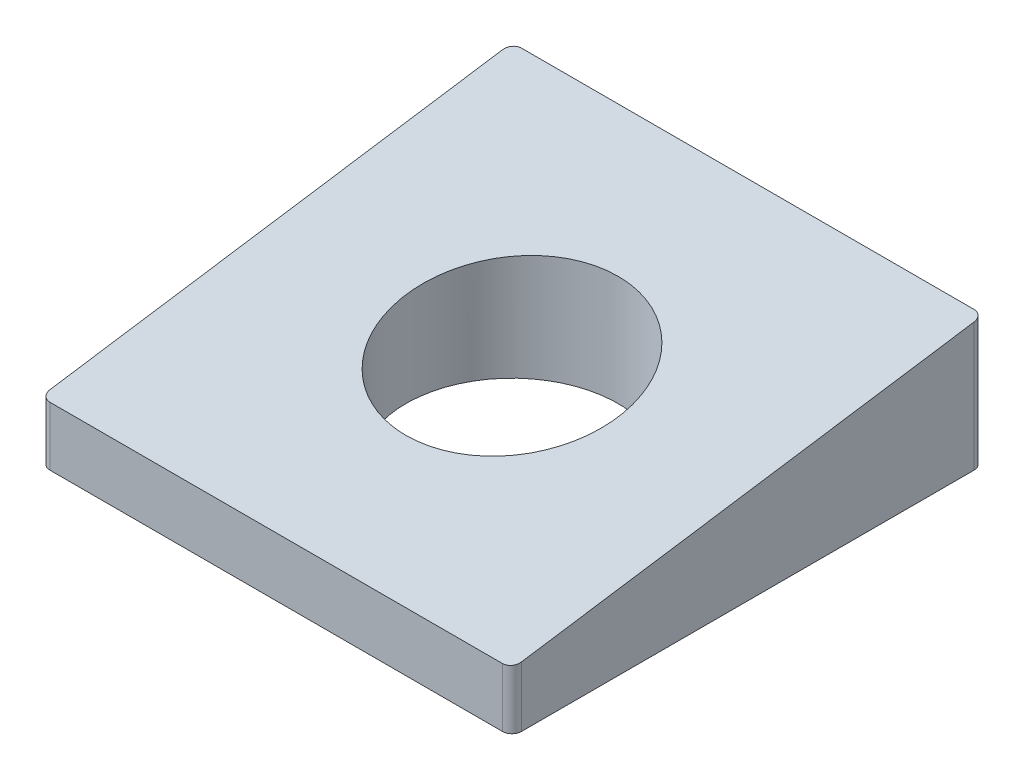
ISO-10303-21;
HEADER;
FILE_DESCRIPTION(('STEP AP214'),'2;1');
FILE_NAME('part.step','',(''),(''),'','','');
FILE_SCHEMA(('AUTOMOTIVE_DESIGN { 1 0 10303 214 1 1 1 1 }'));
ENDSEC;
DATA;
#1=APPLICATION_CONTEXT('core data for automotive mechanical design processes');
#2=APPLICATION_PROTOCOL_DEFINITION('international standard','automotive_design',2000,#1);
#3=PRODUCT_CONTEXT('',#1,'mechanical');
#4=PRODUCT('Part','Part','',(#3));
#5=PRODUCT_RELATED_PRODUCT_CATEGORY('part','',(#4));
#6=PRODUCT_DEFINITION_FORMATION('','',#4);
#7=PRODUCT_DEFINITION_CONTEXT('part definition',#1,'design');
#8=PRODUCT_DEFINITION('design','',#6,#7);
#9=PRODUCT_DEFINITION_SHAPE('','',#8);
#10=(LENGTH_UNIT() NAMED_UNIT(*) SI_UNIT(.MILLI.,.METRE.));
#11=(NAMED_UNIT(*) PLANE_ANGLE_UNIT() SI_UNIT($,.RADIAN.));
#12=(NAMED_UNIT(*) SI_UNIT($,.STERADIAN.) SOLID_ANGLE_UNIT());
#13=UNCERTAINTY_MEASURE_WITH_UNIT(LENGTH_MEASURE(1.E-05),#10,'distance_accuracy_value','');
#14=(GEOMETRIC_REPRESENTATION_CONTEXT(3) GLOBAL_UNCERTAINTY_ASSIGNED_CONTEXT((#13)) GLOBAL_UNIT_ASSIGNED_CONTEXT((#10,
#11,#12)) REPRESENTATION_CONTEXT('',''));
#15=CARTESIAN_POINT('',(0.,0.,0.));
#16=DIRECTION('',(0.,0.,1.));
#17=DIRECTION('',(1.,0.,0.));
#18=AXIS2_PLACEMENT_3D('',#15,#16,#17);
#19=CARTESIAN_POINT('',(-15.875,-4.3688,15.875));
#20=DIRECTION('',(0.,0.,1.));
#21=DIRECTION('',(1.,0.,0.));
#22=AXIS2_PLACEMENT_3D('',#19,#20,#21);
#23=PLANE('',#22);
#24=DIRECTION('',(1.,0.,0.));
#25=VECTOR('',#24,1.);
#26=CARTESIAN_POINT('',(-15.875,-0.406400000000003,15.875));
#27=LINE('',#26,#25);
#28=CARTESIAN_POINT('',(-15.24,-0.406400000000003,15.875));
#29=VERTEX_POINT('',#28);
#30=CARTESIAN_POINT('',(15.24,-0.406400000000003,15.875));
#31=VERTEX_POINT('',#30);
#32=EDGE_CURVE('E134',#29,#31,#27,.T.);
#33=ORIENTED_EDGE('',*,*,#32,.F.);
#34=DIRECTION('',(0.,-1.,0.));
#35=VECTOR('',#34,1.);
#36=CARTESIAN_POINT('',(-15.24,-4.3688,15.875));
#37=LINE('',#36,#35);
#38=CARTESIAN_POINT('',(-15.24,-4.3688,15.875));
#39=VERTEX_POINT('',#38);
#40=EDGE_CURVE('E120',#29,#39,#37,.T.);
#41=ORIENTED_EDGE('',*,*,#40,.T.);
#42=DIRECTION('',(1.,0.,0.));
#43=VECTOR('',#42,1.);
#44=CARTESIAN_POINT('',(-15.875,-4.3688,15.875));
#45=LINE('',#44,#43);
#46=CARTESIAN_POINT('',(15.24,-4.3688,15.875));
#47=VERTEX_POINT('',#46);
#48=EDGE_CURVE('E127',#39,#47,#45,.T.);
#49=ORIENTED_EDGE('',*,*,#48,.T.);
#50=DIRECTION('',(0.,-1.,0.));
#51=VECTOR('',#50,1.);
#52=CARTESIAN_POINT('',(15.24,-4.3688,15.875));
#53=LINE('',#52,#51);
#54=EDGE_CURVE('E139',#47,#31,#53,.F.);
#55=ORIENTED_EDGE('',*,*,#54,.T.);
#56=EDGE_LOOP('',(#33,#41,#49,#55));
#57=FACE_BOUND('',#56,.T.);
#58=ADVANCED_FACE('F44',(#57),#23,.T.);
#59=CARTESIAN_POINT('',(-15.875,-0.406400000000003,15.875));
#60=DIRECTION('',(0.,0.988878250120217,0.148727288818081));
#61=DIRECTION('',(0.,-0.148727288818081,0.988878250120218));
#62=AXIS2_PLACEMENT_3D('',#59,#60,#61);
#63=PLANE('',#62);
#64=CARTESIAN_POINT('',(0.,1.9812,0.));
#65=DIRECTION('',(0.,0.988878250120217,0.148727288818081));
#66=DIRECTION('',(0.,0.148727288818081,-0.988878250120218));
#67=AXIS2_PLACEMENT_3D('',#64,#65,#66);
#68=ELLIPSE('',#67,7.21767315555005,7.1374);
#69=CARTESIAN_POINT('',(0.,3.05466496,-7.1374));
#70=VERTEX_POINT('',#69);
#71=EDGE_CURVE('E199',#70,#70,#68,.T.);
#72=ORIENTED_EDGE('',*,*,#71,.F.);
#73=EDGE_LOOP('',(#72));
#74=FACE_BOUND('',#73,.T.);
#75=DIRECTION('',(0.,-0.148727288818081,0.988878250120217));
#76=VECTOR('',#75,1.);
#77=CARTESIAN_POINT('',(-15.875,-0.406400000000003,15.875));
#78=LINE('',#77,#76);
#79=CARTESIAN_POINT('',(-15.875,4.273296,-15.24));
#80=VERTEX_POINT('',#79);
#81=CARTESIAN_POINT('',(-15.875,-0.310896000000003,15.24));
#82=VERTEX_POINT('',#81);
#83=EDGE_CURVE('E145',#80,#82,#78,.T.);
#84=ORIENTED_EDGE('',*,*,#83,.T.);
#85=CARTESIAN_POINT('',(-15.24,-0.310896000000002,15.24));
#86=DIRECTION('',(0.,0.988878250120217,0.148727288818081));
#87=DIRECTION('',(0.,0.148727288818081,-0.988878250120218));
#88=AXIS2_PLACEMENT_3D('',#85,#86,#87);
#89=ELLIPSE('',#88,0.64214173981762,0.635);
#90=EDGE_CURVE('E174',#82,#29,#89,.T.);
#91=ORIENTED_EDGE('',*,*,#90,.T.);
#92=ORIENTED_EDGE('',*,*,#32,.T.);
#93=CARTESIAN_POINT('',(15.24,-0.310896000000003,15.24));
#94=DIRECTION('',(0.,0.988878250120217,0.148727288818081));
#95=DIRECTION('',(0.,-0.148727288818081,0.988878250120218));
#96=AXIS2_PLACEMENT_3D('',#93,#94,#95);
#97=ELLIPSE('',#96,0.64214173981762,0.635);
#98=CARTESIAN_POINT('',(15.875,-0.310896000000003,15.24));
#99=VERTEX_POINT('',#98);
#100=EDGE_CURVE('E166',#31,#99,#97,.T.);
#101=ORIENTED_EDGE('',*,*,#100,.T.);
#102=DIRECTION('',(0.,-0.148727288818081,0.988878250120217));
#103=VECTOR('',#102,1.);
#104=CARTESIAN_POINT('',(15.875,-0.406400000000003,15.875));
#105=LINE('',#104,#103);
#106=CARTESIAN_POINT('',(15.875,4.273296,-15.24));
#107=VERTEX_POINT('',#106);
#108=EDGE_CURVE('E195',#107,#99,#105,.T.);
#109=ORIENTED_EDGE('',*,*,#108,.F.);
#110=CARTESIAN_POINT('',(15.24,4.273296,-15.24));
#111=DIRECTION('',(0.,0.988878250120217,0.148727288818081));
#112=DIRECTION('',(0.,0.148727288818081,-0.988878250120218));
#113=AXIS2_PLACEMENT_3D('',#110,#111,#112);
#114=ELLIPSE('',#113,0.64214173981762,0.635);
#115=CARTESIAN_POINT('',(15.24,4.3688,-15.875));
#116=VERTEX_POINT('',#115);
#117=EDGE_CURVE('E64',#107,#116,#114,.T.);
#118=ORIENTED_EDGE('',*,*,#117,.T.);
#119=DIRECTION('',(1.,0.,0.));
#120=VECTOR('',#119,1.);
#121=CARTESIAN_POINT('',(-15.875,4.3688,-15.875));
#122=LINE('',#121,#120);
#123=CARTESIAN_POINT('',(-15.24,4.3688,-15.875));
#124=VERTEX_POINT('',#123);
#125=EDGE_CURVE('E150',#124,#116,#122,.T.);
#126=ORIENTED_EDGE('',*,*,#125,.F.);
#127=CARTESIAN_POINT('',(-15.24,4.273296,-15.24));
#128=DIRECTION('',(0.,0.988878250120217,0.148727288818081));
#129=DIRECTION('',(0.,-0.148727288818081,0.988878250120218));
#130=AXIS2_PLACEMENT_3D('',#127,#128,#129);
#131=ELLIPSE('',#130,0.64214173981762,0.635);
#132=EDGE_CURVE('E68',#124,#80,#131,.T.);
#133=ORIENTED_EDGE('',*,*,#132,.T.);
#134=EDGE_LOOP('',(#84,#91,#92,#101,#109,#118,#126,#133));
#135=FACE_BOUND('',#134,.T.);
#136=ADVANCED_FACE('F220',(#74,#135),#63,.T.);
#137=CARTESIAN_POINT('',(-15.875,4.3688,-15.875));
#138=DIRECTION('',(0.,0.,-1.));
#139=DIRECTION('',(-1.,0.,0.));
#140=AXIS2_PLACEMENT_3D('',#137,#138,#139);
#141=PLANE('',#140);
#142=DIRECTION('',(1.,0.,0.));
#143=VECTOR('',#142,1.);
#144=CARTESIAN_POINT('',(-15.875,-4.3688,-15.875));
#145=LINE('',#144,#143);
#146=CARTESIAN_POINT('',(-15.24,-4.3688,-15.875));
#147=VERTEX_POINT('',#146);
#148=CARTESIAN_POINT('',(15.24,-4.3688,-15.875));
#149=VERTEX_POINT('',#148);
#150=EDGE_CURVE('E142',#147,#149,#145,.T.);
#151=ORIENTED_EDGE('',*,*,#150,.F.);
#152=DIRECTION('',(0.,1.,0.));
#153=VECTOR('',#152,1.);
#154=CARTESIAN_POINT('',(-15.24,4.3688,-15.875));
#155=LINE('',#154,#153);
#156=EDGE_CURVE('E181',#147,#124,#155,.T.);
#157=ORIENTED_EDGE('',*,*,#156,.T.);
#158=ORIENTED_EDGE('',*,*,#125,.T.);
#159=DIRECTION('',(0.,1.,0.));
#160=VECTOR('',#159,1.);
#161=CARTESIAN_POINT('',(15.24,4.3688,-15.875));
#162=LINE('',#161,#160);
#163=EDGE_CURVE('E178',#116,#149,#162,.F.);
#164=ORIENTED_EDGE('',*,*,#163,.T.);
#165=EDGE_LOOP('',(#151,#157,#158,#164));
#166=FACE_BOUND('',#165,.T.);
#167=ADVANCED_FACE('F217',(#166),#141,.T.);
#168=CARTESIAN_POINT('',(-15.875,-4.3688,-15.875));
#169=DIRECTION('',(0.,-1.,0.));
#170=DIRECTION('',(0.,0.,-1.));
#171=AXIS2_PLACEMENT_3D('',#168,#169,#170);
#172=PLANE('',#171);
#173=CARTESIAN_POINT('',(0.,-4.3688,0.));
#174=DIRECTION('',(0.,1.,0.));
#175=DIRECTION('',(0.,0.,1.));
#176=AXIS2_PLACEMENT_3D('',#173,#174,#175);
#177=CIRCLE('',#176,7.1374);
#178=CARTESIAN_POINT('',(0.,-4.3688,7.1374));
#179=VERTEX_POINT('',#178);
#180=EDGE_CURVE('E202',#179,#179,#177,.T.);
#181=ORIENTED_EDGE('',*,*,#180,.T.);
#182=EDGE_LOOP('',(#181));
#183=FACE_BOUND('',#182,.T.);
#184=ORIENTED_EDGE('',*,*,#48,.F.);
#185=CARTESIAN_POINT('',(-15.24,-4.3688,15.24));
#186=DIRECTION('',(0.,-1.,0.));
#187=DIRECTION('',(0.,0.,-1.));
#188=AXIS2_PLACEMENT_3D('',#185,#186,#187);
#189=CIRCLE('',#188,0.635);
#190=CARTESIAN_POINT('',(-15.875,-4.3688,15.24));
#191=VERTEX_POINT('',#190);
#192=EDGE_CURVE('E113',#39,#191,#189,.T.);
#193=ORIENTED_EDGE('',*,*,#192,.T.);
#194=DIRECTION('',(0.,0.,-1.));
#195=VECTOR('',#194,1.);
#196=CARTESIAN_POINT('',(-15.875,-4.3688,-15.875));
#197=LINE('',#196,#195);
#198=CARTESIAN_POINT('',(-15.875,-4.3688,-15.24));
#199=VERTEX_POINT('',#198);
#200=EDGE_CURVE('E151',#191,#199,#197,.T.);
#201=ORIENTED_EDGE('',*,*,#200,.T.);
#202=CARTESIAN_POINT('',(-15.24,-4.3688,-15.24));
#203=DIRECTION('',(0.,-1.,0.));
#204=DIRECTION('',(0.,0.,-1.));
#205=AXIS2_PLACEMENT_3D('',#202,#203,#204);
#206=CIRCLE('',#205,0.635);
#207=EDGE_CURVE('E123',#199,#147,#206,.T.);
#208=ORIENTED_EDGE('',*,*,#207,.T.);
#209=ORIENTED_EDGE('',*,*,#150,.T.);
#210=CARTESIAN_POINT('',(15.24,-4.3688,-15.24));
#211=DIRECTION('',(0.,-1.,0.));
#212=DIRECTION('',(0.,0.,-1.));
#213=AXIS2_PLACEMENT_3D('',#210,#211,#212);
#214=CIRCLE('',#213,0.635);
#215=CARTESIAN_POINT('',(15.875,-4.3688,-15.24));
#216=VERTEX_POINT('',#215);
#217=EDGE_CURVE('E157',#149,#216,#214,.T.);
#218=ORIENTED_EDGE('',*,*,#217,.T.);
#219=DIRECTION('',(0.,0.,-1.));
#220=VECTOR('',#219,1.);
#221=CARTESIAN_POINT('',(15.875,-4.3688,-15.875));
#222=LINE('',#221,#220);
#223=CARTESIAN_POINT('',(15.875,-4.3688,15.24));
#224=VERTEX_POINT('',#223);
#225=EDGE_CURVE('E194',#224,#216,#222,.T.);
#226=ORIENTED_EDGE('',*,*,#225,.F.);
#227=CARTESIAN_POINT('',(15.24,-4.3688,15.24));
#228=DIRECTION('',(0.,-1.,0.));
#229=DIRECTION('',(0.,0.,-1.));
#230=AXIS2_PLACEMENT_3D('',#227,#228,#229);
#231=CIRCLE('',#230,0.635);
#232=EDGE_CURVE('E135',#224,#47,#231,.T.);
#233=ORIENTED_EDGE('',*,*,#232,.T.);
#234=EDGE_LOOP('',(#184,#193,#201,#208,#209,#218,#226,#233));
#235=FACE_BOUND('',#234,.T.);
#236=ADVANCED_FACE('F140',(#183,#235),#172,.T.);
#237=CARTESIAN_POINT('',(-15.875,0.,0.));
#238=DIRECTION('',(1.,0.,0.));
#239=DIRECTION('',(0.,0.,-1.));
#240=AXIS2_PLACEMENT_3D('',#237,#238,#239);
#241=PLANE('',#240);
#242=ORIENTED_EDGE('',*,*,#200,.F.);
#243=DIRECTION('',(0.,-1.,0.));
#244=VECTOR('',#243,1.);
#245=CARTESIAN_POINT('',(-15.875,-0.406400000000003,15.24));
#246=LINE('',#245,#244);
#247=EDGE_CURVE('E117',#191,#82,#246,.F.);
#248=ORIENTED_EDGE('',*,*,#247,.T.);
#249=ORIENTED_EDGE('',*,*,#83,.F.);
#250=DIRECTION('',(0.,1.,0.));
#251=VECTOR('',#250,1.);
#252=CARTESIAN_POINT('',(-15.875,-4.3688,-15.24));
#253=LINE('',#252,#251);
#254=EDGE_CURVE('E121',#80,#199,#253,.F.);
#255=ORIENTED_EDGE('',*,*,#254,.T.);
#256=EDGE_LOOP('',(#242,#248,#249,#255));
#257=FACE_BOUND('',#256,.T.);
#258=ADVANCED_FACE('F242',(#257),#241,.F.);
#259=CARTESIAN_POINT('',(15.875,0.,0.));
#260=DIRECTION('',(1.,0.,0.));
#261=DIRECTION('',(0.,0.,-1.));
#262=AXIS2_PLACEMENT_3D('',#259,#260,#261);
#263=PLANE('',#262);
#264=ORIENTED_EDGE('',*,*,#225,.T.);
#265=DIRECTION('',(0.,1.,0.));
#266=VECTOR('',#265,1.);
#267=CARTESIAN_POINT('',(15.875,0.,-15.24));
#268=LINE('',#267,#266);
#269=EDGE_CURVE('E11',#216,#107,#268,.T.);
#270=ORIENTED_EDGE('',*,*,#269,.T.);
#271=ORIENTED_EDGE('',*,*,#108,.T.);
#272=DIRECTION('',(0.,-1.,0.));
#273=VECTOR('',#272,1.);
#274=CARTESIAN_POINT('',(15.875,0.,15.24));
#275=LINE('',#274,#273);
#276=EDGE_CURVE('E53',#99,#224,#275,.T.);
#277=ORIENTED_EDGE('',*,*,#276,.T.);
#278=EDGE_LOOP('',(#264,#270,#271,#277));
#279=FACE_BOUND('',#278,.T.);
#280=ADVANCED_FACE('F188',(#279),#263,.T.);
#281=CARTESIAN_POINT('',(0.,-4.3688,0.));
#282=DIRECTION('',(0.,1.,0.));
#283=DIRECTION('',(0.,0.,1.));
#284=AXIS2_PLACEMENT_3D('',#281,#282,#283);
#285=CYLINDRICAL_SURFACE('',#284,7.1374);
#286=ORIENTED_EDGE('',*,*,#71,.T.);
#287=EDGE_LOOP('',(#286));
#288=FACE_BOUND('',#287,.T.);
#289=ORIENTED_EDGE('',*,*,#180,.F.);
#290=EDGE_LOOP('',(#289));
#291=FACE_BOUND('',#290,.T.);
#292=ADVANCED_FACE('F238',(#288,#291),#285,.F.);
#293=CARTESIAN_POINT('',(-15.24,-4.3688,15.24));
#294=DIRECTION('',(0.,1.,0.));
#295=DIRECTION('',(0.,0.,1.));
#296=AXIS2_PLACEMENT_3D('',#293,#294,#295);
#297=CYLINDRICAL_SURFACE('',#296,0.635);
#298=ORIENTED_EDGE('',*,*,#90,.F.);
#299=ORIENTED_EDGE('',*,*,#247,.F.);
#300=ORIENTED_EDGE('',*,*,#192,.F.);
#301=ORIENTED_EDGE('',*,*,#40,.F.);
#302=EDGE_LOOP('',(#298,#299,#300,#301));
#303=FACE_BOUND('',#302,.T.);
#304=ADVANCED_FACE('F116',(#303),#297,.T.);
#305=CARTESIAN_POINT('',(-15.24,4.3688,-15.24));
#306=DIRECTION('',(0.,-1.,0.));
#307=DIRECTION('',(0.,0.,-1.));
#308=AXIS2_PLACEMENT_3D('',#305,#306,#307);
#309=CYLINDRICAL_SURFACE('',#308,0.635);
#310=ORIENTED_EDGE('',*,*,#207,.F.);
#311=ORIENTED_EDGE('',*,*,#254,.F.);
#312=ORIENTED_EDGE('',*,*,#132,.F.);
#313=ORIENTED_EDGE('',*,*,#156,.F.);
#314=EDGE_LOOP('',(#310,#311,#312,#313));
#315=FACE_BOUND('',#314,.T.);
#316=ADVANCED_FACE('F224',(#315),#309,.T.);
#317=CARTESIAN_POINT('',(15.24,0.,-15.24));
#318=DIRECTION('',(0.,1.,0.));
#319=DIRECTION('',(0.,0.,1.));
#320=AXIS2_PLACEMENT_3D('',#317,#318,#319);
#321=CYLINDRICAL_SURFACE('',#320,0.635);
#322=ORIENTED_EDGE('',*,*,#217,.F.);
#323=ORIENTED_EDGE('',*,*,#163,.F.);
#324=ORIENTED_EDGE('',*,*,#117,.F.);
#325=ORIENTED_EDGE('',*,*,#269,.F.);
#326=EDGE_LOOP('',(#322,#323,#324,#325));
#327=FACE_BOUND('',#326,.T.);
#328=ADVANCED_FACE('F218',(#327),#321,.T.);
#329=CARTESIAN_POINT('',(15.24,0.,15.24));
#330=DIRECTION('',(0.,-1.,0.));
#331=DIRECTION('',(0.,0.,-1.));
#332=AXIS2_PLACEMENT_3D('',#329,#330,#331);
#333=CYLINDRICAL_SURFACE('',#332,0.635);
#334=ORIENTED_EDGE('',*,*,#100,.F.);
#335=ORIENTED_EDGE('',*,*,#54,.F.);
#336=ORIENTED_EDGE('',*,*,#232,.F.);
#337=ORIENTED_EDGE('',*,*,#276,.F.);
#338=EDGE_LOOP('',(#334,#335,#336,#337));
#339=FACE_BOUND('',#338,.T.);
#340=ADVANCED_FACE('F50',(#339),#333,.T.);
#341=CLOSED_SHELL('',(#58,#136,#167,#236,#258,#280,#292,#304,#316,#328,#340));
#342=MANIFOLD_SOLID_BREP('B2',#341);
#343=ADVANCED_BREP_SHAPE_REPRESENTATION('',(#18,#342),#14);
#344=SHAPE_DEFINITION_REPRESENTATION(#9,#343);
ENDSEC;
END-ISO-10303-21;
